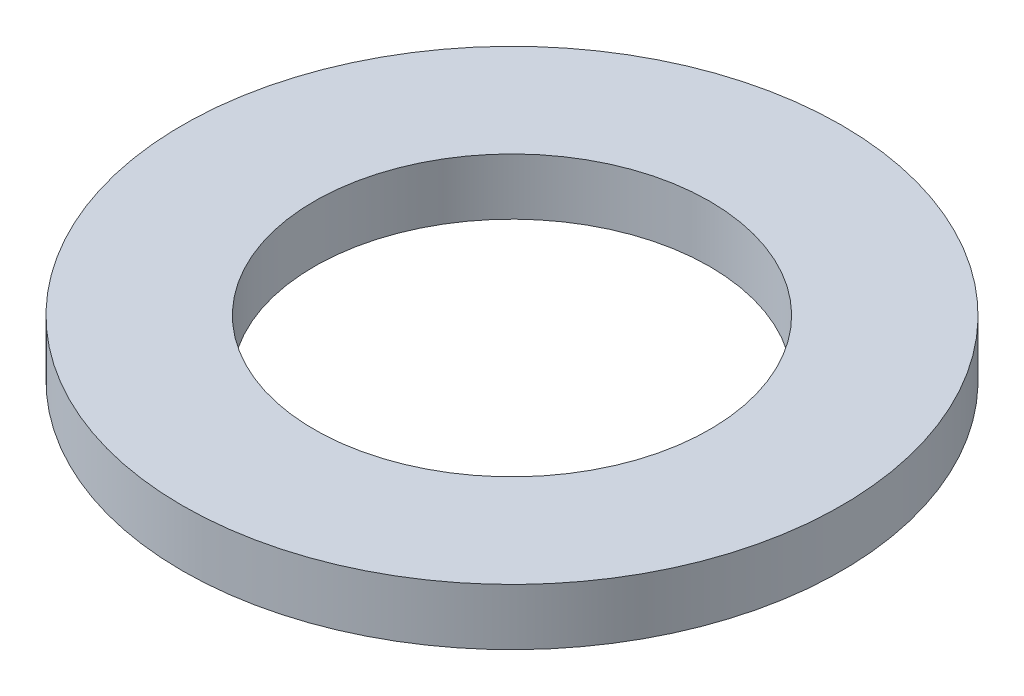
ISO-10303-21;
HEADER;
FILE_DESCRIPTION(('STEP AP214'),'2;1');
FILE_NAME('part.step','',(''),(''),'','','');
FILE_SCHEMA(('AUTOMOTIVE_DESIGN { 1 0 10303 214 1 1 1 1 }'));
ENDSEC;
DATA;
#1=APPLICATION_CONTEXT('core data for automotive mechanical design processes');
#2=APPLICATION_PROTOCOL_DEFINITION('international standard','automotive_design',2000,#1);
#3=PRODUCT_CONTEXT('',#1,'mechanical');
#4=PRODUCT('Part','Part','',(#3));
#5=PRODUCT_RELATED_PRODUCT_CATEGORY('part','',(#4));
#6=PRODUCT_DEFINITION_FORMATION('','',#4);
#7=PRODUCT_DEFINITION_CONTEXT('part definition',#1,'design');
#8=PRODUCT_DEFINITION('design','',#6,#7);
#9=PRODUCT_DEFINITION_SHAPE('','',#8);
#10=(LENGTH_UNIT() NAMED_UNIT(*) SI_UNIT(.MILLI.,.METRE.));
#11=(NAMED_UNIT(*) PLANE_ANGLE_UNIT() SI_UNIT($,.RADIAN.));
#12=(NAMED_UNIT(*) SI_UNIT($,.STERADIAN.) SOLID_ANGLE_UNIT());
#13=UNCERTAINTY_MEASURE_WITH_UNIT(LENGTH_MEASURE(1.E-05),#10,'distance_accuracy_value','');
#14=(GEOMETRIC_REPRESENTATION_CONTEXT(3) GLOBAL_UNCERTAINTY_ASSIGNED_CONTEXT((#13)) GLOBAL_UNIT_ASSIGNED_CONTEXT((#10,
#11,#12)) REPRESENTATION_CONTEXT('',''));
#15=CARTESIAN_POINT('',(0.,0.,0.));
#16=DIRECTION('',(0.,0.,1.));
#17=DIRECTION('',(1.,0.,0.));
#18=AXIS2_PLACEMENT_3D('',#15,#16,#17);
#19=CARTESIAN_POINT('',(0.,0.,0.));
#20=DIRECTION('',(0.,-1.,0.));
#21=DIRECTION('',(0.,0.,-1.));
#22=AXIS2_PLACEMENT_3D('',#19,#20,#21);
#23=CYLINDRICAL_SURFACE('',#22,7.);
#24=CARTESIAN_POINT('',(0.,1.2,0.));
#25=DIRECTION('',(0.,-1.,0.));
#26=DIRECTION('',(0.,0.,-1.));
#27=AXIS2_PLACEMENT_3D('',#24,#25,#26);
#28=CIRCLE('',#27,7.);
#29=CARTESIAN_POINT('',(0.,1.2,-7.));
#30=VERTEX_POINT('',#29);
#31=EDGE_CURVE('E10',#30,#30,#28,.T.);
#32=ORIENTED_EDGE('',*,*,#31,.T.);
#33=EDGE_LOOP('',(#32));
#34=FACE_BOUND('',#33,.T.);
#35=CARTESIAN_POINT('',(0.,0.,0.));
#36=DIRECTION('',(0.,-1.,0.));
#37=DIRECTION('',(0.,0.,-1.));
#38=AXIS2_PLACEMENT_3D('',#35,#36,#37);
#39=CIRCLE('',#38,7.);
#40=CARTESIAN_POINT('',(0.,0.,-7.));
#41=VERTEX_POINT('',#40);
#42=EDGE_CURVE('E44',#41,#41,#39,.T.);
#43=ORIENTED_EDGE('',*,*,#42,.F.);
#44=EDGE_LOOP('',(#43));
#45=FACE_BOUND('',#44,.T.);
#46=ADVANCED_FACE('F30',(#34,#45),#23,.T.);
#47=CARTESIAN_POINT('',(7.,1.2,0.));
#48=DIRECTION('',(0.,1.,0.));
#49=DIRECTION('',(0.,0.,1.));
#50=AXIS2_PLACEMENT_3D('',#47,#48,#49);
#51=PLANE('',#50);
#52=CARTESIAN_POINT('',(0.,1.2,0.));
#53=DIRECTION('',(0.,-1.,0.));
#54=DIRECTION('',(0.,0.,-1.));
#55=AXIS2_PLACEMENT_3D('',#52,#53,#54);
#56=CIRCLE('',#55,4.2);
#57=CARTESIAN_POINT('',(0.,1.2,-4.2));
#58=VERTEX_POINT('',#57);
#59=EDGE_CURVE('E36',#58,#58,#56,.T.);
#60=ORIENTED_EDGE('',*,*,#59,.T.);
#61=EDGE_LOOP('',(#60));
#62=FACE_BOUND('',#61,.T.);
#63=ORIENTED_EDGE('',*,*,#31,.F.);
#64=EDGE_LOOP('',(#63));
#65=FACE_BOUND('',#64,.T.);
#66=ADVANCED_FACE('F54',(#62,#65),#51,.T.);
#67=CARTESIAN_POINT('',(0.,0.,0.));
#68=DIRECTION('',(0.,-1.,0.));
#69=DIRECTION('',(0.,0.,-1.));
#70=AXIS2_PLACEMENT_3D('',#67,#68,#69);
#71=CYLINDRICAL_SURFACE('',#70,4.2);
#72=CARTESIAN_POINT('',(0.,0.,0.));
#73=DIRECTION('',(0.,-1.,0.));
#74=DIRECTION('',(0.,0.,-1.));
#75=AXIS2_PLACEMENT_3D('',#72,#73,#74);
#76=CIRCLE('',#75,4.2);
#77=CARTESIAN_POINT('',(0.,0.,-4.2));
#78=VERTEX_POINT('',#77);
#79=EDGE_CURVE('E40',#78,#78,#76,.T.);
#80=ORIENTED_EDGE('',*,*,#79,.T.);
#81=EDGE_LOOP('',(#80));
#82=FACE_BOUND('',#81,.T.);
#83=ORIENTED_EDGE('',*,*,#59,.F.);
#84=EDGE_LOOP('',(#83));
#85=FACE_BOUND('',#84,.T.);
#86=ADVANCED_FACE('F58',(#82,#85),#71,.F.);
#87=CARTESIAN_POINT('',(4.2,0.,0.));
#88=DIRECTION('',(0.,-1.,0.));
#89=DIRECTION('',(0.,0.,-1.));
#90=AXIS2_PLACEMENT_3D('',#87,#88,#89);
#91=PLANE('',#90);
#92=ORIENTED_EDGE('',*,*,#42,.T.);
#93=EDGE_LOOP('',(#92));
#94=FACE_BOUND('',#93,.T.);
#95=ORIENTED_EDGE('',*,*,#79,.F.);
#96=EDGE_LOOP('',(#95));
#97=FACE_BOUND('',#96,.T.);
#98=ADVANCED_FACE('F50',(#94,#97),#91,.T.);
#99=CLOSED_SHELL('',(#46,#66,#86,#98));
#100=MANIFOLD_SOLID_BREP('B2',#99);
#101=ADVANCED_BREP_SHAPE_REPRESENTATION('',(#18,#100),#14);
#102=SHAPE_DEFINITION_REPRESENTATION(#9,#101);
ENDSEC;
END-ISO-10303-21;
